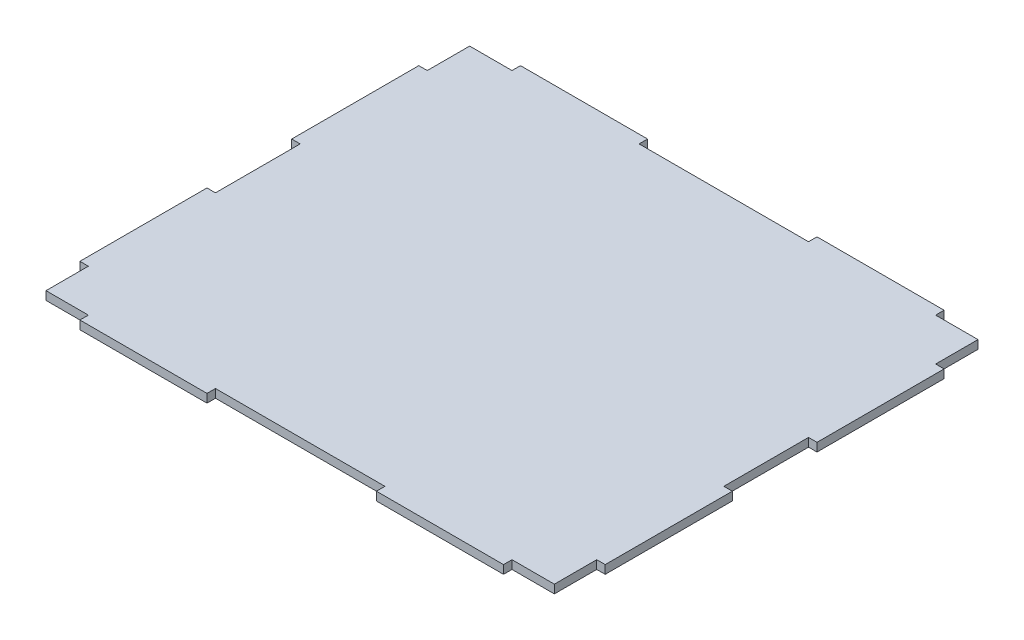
from build123d import *

# Parameters (mm, degrees)
SALIENTE_EXTRUIR1_DEPTH = 20


with BuildPart() as part:
    # Croquis1 → Saliente-Extruir1 (new body)
    with BuildSketch(Plane(origin=(0, 0, 0), x_dir=(1, 0, 0), z_dir=(0, 1, 0))):
        Polygon((-600, -500), (-500, -500), (-500, -520), (-200, -520), (-200, -500), (200, -500), (200, -520), (500, -520), (500, -500), (600, -500), (600, -400), (620, -400), (620, -100), (600, -100), (600, 100), (620, 100), (620, 400), (600, 400), (600, 500), (500, 500), (500, 520), (200, 520), (200, 500), (-200, 500), (-200, 520), (-500, 520), (-500, 500), (-600, 500), (-600, 400), (-620, 400), (-620, 100), (-600, 100), (-600, -100), (-620, -100), (-620, -400), (-600, -400), align=None)
    extrude(amount=SALIENTE_EXTRUIR1_DEPTH)


solid = part.part
